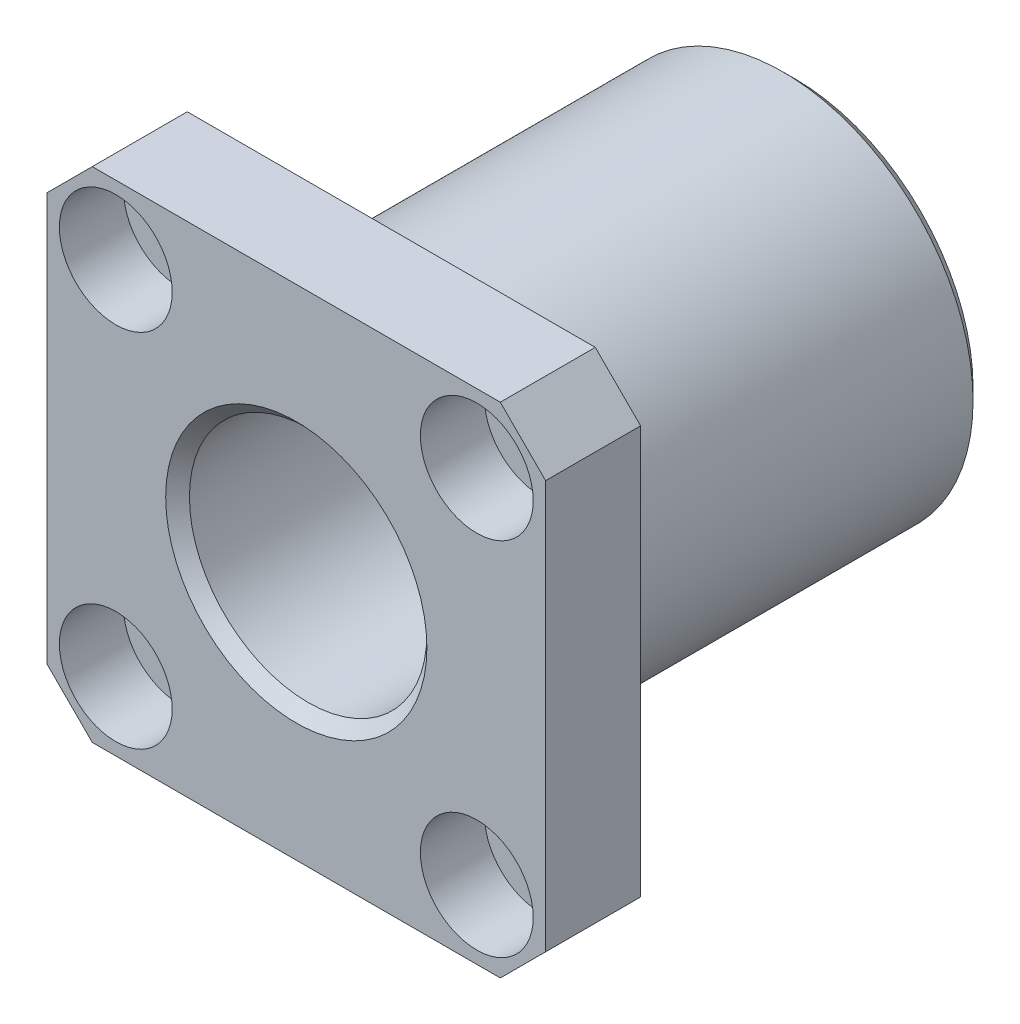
ISO-10303-21;
HEADER;
FILE_DESCRIPTION(('STEP AP214'),'2;1');
FILE_NAME('part.step','',(''),(''),'','','');
FILE_SCHEMA(('AUTOMOTIVE_DESIGN { 1 0 10303 214 1 1 1 1 }'));
ENDSEC;
DATA;
#1=APPLICATION_CONTEXT('core data for automotive mechanical design processes');
#2=APPLICATION_PROTOCOL_DEFINITION('international standard','automotive_design',2000,#1);
#3=PRODUCT_CONTEXT('',#1,'mechanical');
#4=PRODUCT('Part','Part','',(#3));
#5=PRODUCT_RELATED_PRODUCT_CATEGORY('part','',(#4));
#6=PRODUCT_DEFINITION_FORMATION('','',#4);
#7=PRODUCT_DEFINITION_CONTEXT('part definition',#1,'design');
#8=PRODUCT_DEFINITION('design','',#6,#7);
#9=PRODUCT_DEFINITION_SHAPE('','',#8);
#10=(LENGTH_UNIT() NAMED_UNIT(*) SI_UNIT(.MILLI.,.METRE.));
#11=(NAMED_UNIT(*) PLANE_ANGLE_UNIT() SI_UNIT($,.RADIAN.));
#12=(NAMED_UNIT(*) SI_UNIT($,.STERADIAN.) SOLID_ANGLE_UNIT());
#13=UNCERTAINTY_MEASURE_WITH_UNIT(LENGTH_MEASURE(1.E-05),#10,'distance_accuracy_value','');
#14=(GEOMETRIC_REPRESENTATION_CONTEXT(3) GLOBAL_UNCERTAINTY_ASSIGNED_CONTEXT((#13)) GLOBAL_UNIT_ASSIGNED_CONTEXT((#10,
#11,#12)) REPRESENTATION_CONTEXT('',''));
#15=CARTESIAN_POINT('',(0.,0.,0.));
#16=DIRECTION('',(0.,0.,1.));
#17=DIRECTION('',(1.,0.,0.));
#18=AXIS2_PLACEMENT_3D('',#15,#16,#17);
#19=CARTESIAN_POINT('',(0.,0.,41.));
#20=DIRECTION('',(0.,0.,1.));
#21=DIRECTION('',(1.,0.,0.));
#22=AXIS2_PLACEMENT_3D('',#19,#20,#21);
#23=CONICAL_SURFACE('',#22,10.,0.785398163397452);
#24=CARTESIAN_POINT('',(0.,0.,41.));
#25=DIRECTION('',(0.,0.,1.));
#26=DIRECTION('',(1.,0.,0.));
#27=AXIS2_PLACEMENT_3D('',#24,#25,#26);
#28=CIRCLE('',#27,10.);
#29=CARTESIAN_POINT('',(10.,0.,41.));
#30=VERTEX_POINT('',#29);
#31=CARTESIAN_POINT('',(-10.,0.,41.));
#32=VERTEX_POINT('',#31);
#33=EDGE_CURVE('E36',#30,#32,#28,.T.);
#34=ORIENTED_EDGE('',*,*,#33,.F.);
#35=CARTESIAN_POINT('',(0.,0.,41.));
#36=DIRECTION('',(0.,0.,1.));
#37=DIRECTION('',(1.,0.,0.));
#38=AXIS2_PLACEMENT_3D('',#35,#36,#37);
#39=CIRCLE('',#38,10.);
#40=EDGE_CURVE('E465',#32,#30,#39,.T.);
#41=ORIENTED_EDGE('',*,*,#40,.F.);
#42=DIRECTION('',(-0.70710678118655,0.,0.707106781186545));
#43=VECTOR('',#42,1.);
#44=CARTESIAN_POINT('',(-10.,0.,41.));
#45=LINE('',#44,#43);
#46=CARTESIAN_POINT('',(-11.,0.,42.));
#47=VERTEX_POINT('',#46);
#48=EDGE_CURVE('E9',#32,#47,#45,.T.);
#49=ORIENTED_EDGE('',*,*,#48,.T.);
#50=CARTESIAN_POINT('',(0.,0.,42.));
#51=DIRECTION('',(0.,0.,-1.));
#52=DIRECTION('',(1.,0.,0.));
#53=AXIS2_PLACEMENT_3D('',#50,#51,#52);
#54=CIRCLE('',#53,11.);
#55=CARTESIAN_POINT('',(11.,0.,42.));
#56=VERTEX_POINT('',#55);
#57=EDGE_CURVE('E374',#56,#47,#54,.T.);
#58=ORIENTED_EDGE('',*,*,#57,.F.);
#59=CARTESIAN_POINT('',(0.,0.,42.));
#60=DIRECTION('',(0.,0.,-1.));
#61=DIRECTION('',(1.,0.,0.));
#62=AXIS2_PLACEMENT_3D('',#59,#60,#61);
#63=CIRCLE('',#62,11.);
#64=EDGE_CURVE('E383',#47,#56,#63,.T.);
#65=ORIENTED_EDGE('',*,*,#64,.F.);
#66=ORIENTED_EDGE('',*,*,#48,.F.);
#67=EDGE_LOOP('',(#34,#41,#49,#58,#65,#66));
#68=FACE_BOUND('',#67,.T.);
#69=ADVANCED_FACE('F15',(#68),#23,.F.);
#70=CARTESIAN_POINT('',(0.,0.,1.00000000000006));
#71=DIRECTION('',(0.,0.,1.));
#72=DIRECTION('',(1.,0.,0.));
#73=AXIS2_PLACEMENT_3D('',#70,#71,#72);
#74=CONICAL_SURFACE('',#73,16.,0.78539816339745);
#75=CARTESIAN_POINT('',(0.,0.,1.00000000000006));
#76=DIRECTION('',(0.,0.,1.));
#77=DIRECTION('',(1.,0.,0.));
#78=AXIS2_PLACEMENT_3D('',#75,#76,#77);
#79=CIRCLE('',#78,16.);
#80=CARTESIAN_POINT('',(16.,0.,1.00000000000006));
#81=VERTEX_POINT('',#80);
#82=CARTESIAN_POINT('',(-16.,0.,1.00000000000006));
#83=VERTEX_POINT('',#82);
#84=EDGE_CURVE('E616',#81,#83,#79,.T.);
#85=ORIENTED_EDGE('',*,*,#84,.F.);
#86=CARTESIAN_POINT('',(0.,0.,1.00000000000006));
#87=DIRECTION('',(0.,0.,1.));
#88=DIRECTION('',(1.,0.,0.));
#89=AXIS2_PLACEMENT_3D('',#86,#87,#88);
#90=CIRCLE('',#89,16.);
#91=EDGE_CURVE('E480',#83,#81,#90,.T.);
#92=ORIENTED_EDGE('',*,*,#91,.F.);
#93=DIRECTION('',(0.707106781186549,0.,-0.707106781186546));
#94=VECTOR('',#93,1.);
#95=CARTESIAN_POINT('',(-16.,0.,1.00000000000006));
#96=LINE('',#95,#94);
#97=CARTESIAN_POINT('',(-15.,0.,0.));
#98=VERTEX_POINT('',#97);
#99=EDGE_CURVE('E24',#83,#98,#96,.T.);
#100=ORIENTED_EDGE('',*,*,#99,.T.);
#101=CARTESIAN_POINT('',(0.,0.,0.));
#102=DIRECTION('',(0.,0.,-1.));
#103=DIRECTION('',(1.,0.,0.));
#104=AXIS2_PLACEMENT_3D('',#101,#102,#103);
#105=CIRCLE('',#104,15.);
#106=CARTESIAN_POINT('',(15.,0.,0.));
#107=VERTEX_POINT('',#106);
#108=EDGE_CURVE('E478',#107,#98,#105,.T.);
#109=ORIENTED_EDGE('',*,*,#108,.F.);
#110=CARTESIAN_POINT('',(0.,0.,0.));
#111=DIRECTION('',(0.,0.,-1.));
#112=DIRECTION('',(1.,0.,0.));
#113=AXIS2_PLACEMENT_3D('',#110,#111,#112);
#114=CIRCLE('',#113,15.);
#115=EDGE_CURVE('E482',#98,#107,#114,.T.);
#116=ORIENTED_EDGE('',*,*,#115,.F.);
#117=ORIENTED_EDGE('',*,*,#99,.F.);
#118=EDGE_LOOP('',(#85,#92,#100,#109,#116,#117));
#119=FACE_BOUND('',#118,.T.);
#120=ADVANCED_FACE('F17',(#119),#74,.T.);
#121=CARTESIAN_POINT('',(0.,0.,0.));
#122=DIRECTION('',(0.,0.,1.));
#123=DIRECTION('',(1.,0.,0.));
#124=AXIS2_PLACEMENT_3D('',#121,#122,#123);
#125=CYLINDRICAL_SURFACE('',#124,10.);
#126=CARTESIAN_POINT('',(0.,0.,0.));
#127=DIRECTION('',(0.,0.,1.));
#128=DIRECTION('',(1.,0.,0.));
#129=AXIS2_PLACEMENT_3D('',#126,#127,#128);
#130=CIRCLE('',#129,10.);
#131=CARTESIAN_POINT('',(10.,0.,0.));
#132=VERTEX_POINT('',#131);
#133=CARTESIAN_POINT('',(-10.,0.,0.));
#134=VERTEX_POINT('',#133);
#135=EDGE_CURVE('E485',#132,#134,#130,.T.);
#136=ORIENTED_EDGE('',*,*,#135,.F.);
#137=CARTESIAN_POINT('',(0.,0.,0.));
#138=DIRECTION('',(0.,0.,1.));
#139=DIRECTION('',(1.,0.,0.));
#140=AXIS2_PLACEMENT_3D('',#137,#138,#139);
#141=CIRCLE('',#140,10.);
#142=EDGE_CURVE('E505',#134,#132,#141,.T.);
#143=ORIENTED_EDGE('',*,*,#142,.F.);
#144=DIRECTION('',(0.,0.,1.));
#145=VECTOR('',#144,1.);
#146=CARTESIAN_POINT('',(-10.,0.,0.));
#147=LINE('',#146,#145);
#148=EDGE_CURVE('E461',#134,#32,#147,.T.);
#149=ORIENTED_EDGE('',*,*,#148,.T.);
#150=ORIENTED_EDGE('',*,*,#40,.T.);
#151=ORIENTED_EDGE('',*,*,#33,.T.);
#152=ORIENTED_EDGE('',*,*,#148,.F.);
#153=EDGE_LOOP('',(#136,#143,#149,#150,#151,#152));
#154=FACE_BOUND('',#153,.T.);
#155=ADVANCED_FACE('F578',(#154),#125,.F.);
#156=CARTESIAN_POINT('',(-15.2027957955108,15.2027957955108,42.));
#157=DIRECTION('',(0.,0.,1.));
#158=DIRECTION('',(1.,0.,0.));
#159=AXIS2_PLACEMENT_3D('',#156,#157,#158);
#160=CYLINDRICAL_SURFACE('',#159,4.75);
#161=CARTESIAN_POINT('',(-15.2027957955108,15.2027957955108,36.6));
#162=DIRECTION('',(0.,0.,1.));
#163=DIRECTION('',(1.,0.,0.));
#164=AXIS2_PLACEMENT_3D('',#161,#162,#163);
#165=CIRCLE('',#164,4.75);
#166=CARTESIAN_POINT('',(-10.4527957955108,15.2027957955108,36.6));
#167=VERTEX_POINT('',#166);
#168=CARTESIAN_POINT('',(-19.9527957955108,15.2027957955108,36.6));
#169=VERTEX_POINT('',#168);
#170=EDGE_CURVE('E451',#167,#169,#165,.T.);
#171=ORIENTED_EDGE('',*,*,#170,.F.);
#172=CARTESIAN_POINT('',(-15.2027957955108,15.2027957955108,36.6));
#173=DIRECTION('',(0.,0.,1.));
#174=DIRECTION('',(1.,0.,0.));
#175=AXIS2_PLACEMENT_3D('',#172,#173,#174);
#176=CIRCLE('',#175,4.75);
#177=EDGE_CURVE('E455',#169,#167,#176,.T.);
#178=ORIENTED_EDGE('',*,*,#177,.F.);
#179=DIRECTION('',(0.,0.,1.));
#180=VECTOR('',#179,1.);
#181=CARTESIAN_POINT('',(-19.9527957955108,15.2027957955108,42.));
#182=LINE('',#181,#180);
#183=CARTESIAN_POINT('',(-19.9527957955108,15.2027957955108,42.));
#184=VERTEX_POINT('',#183);
#185=EDGE_CURVE('E458',#169,#184,#182,.T.);
#186=ORIENTED_EDGE('',*,*,#185,.T.);
#187=CARTESIAN_POINT('',(-15.2027957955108,15.2027957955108,42.));
#188=DIRECTION('',(0.,0.,1.));
#189=DIRECTION('',(1.,0.,0.));
#190=AXIS2_PLACEMENT_3D('',#187,#188,#189);
#191=CIRCLE('',#190,4.75);
#192=CARTESIAN_POINT('',(-10.4527957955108,15.2027957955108,42.));
#193=VERTEX_POINT('',#192);
#194=EDGE_CURVE('E390',#184,#193,#191,.T.);
#195=ORIENTED_EDGE('',*,*,#194,.T.);
#196=CARTESIAN_POINT('',(-15.2027957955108,15.2027957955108,42.));
#197=DIRECTION('',(0.,0.,1.));
#198=DIRECTION('',(1.,0.,0.));
#199=AXIS2_PLACEMENT_3D('',#196,#197,#198);
#200=CIRCLE('',#199,4.75);
#201=EDGE_CURVE('E386',#193,#184,#200,.T.);
#202=ORIENTED_EDGE('',*,*,#201,.T.);
#203=ORIENTED_EDGE('',*,*,#185,.F.);
#204=EDGE_LOOP('',(#171,#178,#186,#195,#202,#203));
#205=FACE_BOUND('',#204,.T.);
#206=ADVANCED_FACE('F594',(#205),#160,.F.);
#207=CARTESIAN_POINT('',(-12.4527957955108,15.2027957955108,36.6));
#208=DIRECTION('',(0.,0.,-1.));
#209=DIRECTION('',(0.,-1.,0.));
#210=AXIS2_PLACEMENT_3D('',#207,#208,#209);
#211=PLANE('',#210);
#212=CARTESIAN_POINT('',(-15.2027957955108,15.2027957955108,36.6));
#213=DIRECTION('',(0.,0.,1.));
#214=DIRECTION('',(1.,0.,0.));
#215=AXIS2_PLACEMENT_3D('',#212,#213,#214);
#216=CIRCLE('',#215,2.75);
#217=CARTESIAN_POINT('',(-12.4527957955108,15.2027957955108,36.6));
#218=VERTEX_POINT('',#217);
#219=CARTESIAN_POINT('',(-17.9527957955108,15.2027957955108,36.6));
#220=VERTEX_POINT('',#219);
#221=EDGE_CURVE('E448',#218,#220,#216,.T.);
#222=ORIENTED_EDGE('',*,*,#221,.F.);
#223=CARTESIAN_POINT('',(-15.2027957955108,15.2027957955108,36.6));
#224=DIRECTION('',(0.,0.,1.));
#225=DIRECTION('',(1.,0.,0.));
#226=AXIS2_PLACEMENT_3D('',#223,#224,#225);
#227=CIRCLE('',#226,2.75);
#228=EDGE_CURVE('E444',#220,#218,#227,.T.);
#229=ORIENTED_EDGE('',*,*,#228,.F.);
#230=EDGE_LOOP('',(#222,#229));
#231=FACE_BOUND('',#230,.T.);
#232=ORIENTED_EDGE('',*,*,#170,.T.);
#233=ORIENTED_EDGE('',*,*,#177,.T.);
#234=EDGE_LOOP('',(#232,#233));
#235=FACE_BOUND('',#234,.T.);
#236=ADVANCED_FACE('F592',(#231,#235),#211,.F.);
#237=CARTESIAN_POINT('',(-15.2027957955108,15.2027957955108,42.));
#238=DIRECTION('',(0.,0.,1.));
#239=DIRECTION('',(1.,0.,0.));
#240=AXIS2_PLACEMENT_3D('',#237,#238,#239);
#241=CYLINDRICAL_SURFACE('',#240,2.75);
#242=CARTESIAN_POINT('',(-15.2027957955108,15.2027957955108,34.));
#243=DIRECTION('',(0.,0.,-1.));
#244=DIRECTION('',(-1.,0.,0.));
#245=AXIS2_PLACEMENT_3D('',#242,#243,#244);
#246=CIRCLE('',#245,2.75);
#247=CARTESIAN_POINT('',(-17.9527957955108,15.2027957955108,34.));
#248=VERTEX_POINT('',#247);
#249=EDGE_CURVE('E350',#248,#248,#246,.T.);
#250=ORIENTED_EDGE('',*,*,#249,.T.);
#251=DIRECTION('',(0.,0.,1.));
#252=VECTOR('',#251,1.);
#253=CARTESIAN_POINT('',(-17.9527957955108,15.2027957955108,42.));
#254=LINE('',#253,#252);
#255=EDGE_CURVE('E378',#248,#220,#254,.T.);
#256=ORIENTED_EDGE('',*,*,#255,.T.);
#257=ORIENTED_EDGE('',*,*,#228,.T.);
#258=ORIENTED_EDGE('',*,*,#221,.T.);
#259=ORIENTED_EDGE('',*,*,#255,.F.);
#260=EDGE_LOOP('',(#250,#256,#257,#258,#259));
#261=FACE_BOUND('',#260,.T.);
#262=ADVANCED_FACE('F590',(#261),#241,.F.);
#263=CARTESIAN_POINT('',(15.2027957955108,15.2027957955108,42.));
#264=DIRECTION('',(0.,0.,1.));
#265=DIRECTION('',(1.,0.,0.));
#266=AXIS2_PLACEMENT_3D('',#263,#264,#265);
#267=CYLINDRICAL_SURFACE('',#266,4.75);
#268=CARTESIAN_POINT('',(15.2027957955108,15.2027957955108,36.6));
#269=DIRECTION('',(0.,0.,1.));
#270=DIRECTION('',(1.,0.,0.));
#271=AXIS2_PLACEMENT_3D('',#268,#269,#270);
#272=CIRCLE('',#271,4.75);
#273=CARTESIAN_POINT('',(19.9527957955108,15.2027957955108,36.6));
#274=VERTEX_POINT('',#273);
#275=CARTESIAN_POINT('',(10.4527957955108,15.2027957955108,36.6));
#276=VERTEX_POINT('',#275);
#277=EDGE_CURVE('E417',#274,#276,#272,.T.);
#278=ORIENTED_EDGE('',*,*,#277,.F.);
#279=CARTESIAN_POINT('',(15.2027957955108,15.2027957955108,36.6));
#280=DIRECTION('',(0.,0.,1.));
#281=DIRECTION('',(1.,0.,0.));
#282=AXIS2_PLACEMENT_3D('',#279,#280,#281);
#283=CIRCLE('',#282,4.75);
#284=EDGE_CURVE('E379',#276,#274,#283,.T.);
#285=ORIENTED_EDGE('',*,*,#284,.F.);
#286=DIRECTION('',(0.,0.,1.));
#287=VECTOR('',#286,1.);
#288=CARTESIAN_POINT('',(10.4527957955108,15.2027957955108,42.));
#289=LINE('',#288,#287);
#290=CARTESIAN_POINT('',(10.4527957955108,15.2027957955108,42.));
#291=VERTEX_POINT('',#290);
#292=EDGE_CURVE('E375',#276,#291,#289,.T.);
#293=ORIENTED_EDGE('',*,*,#292,.T.);
#294=CARTESIAN_POINT('',(15.2027957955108,15.2027957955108,42.));
#295=DIRECTION('',(0.,0.,1.));
#296=DIRECTION('',(1.,0.,0.));
#297=AXIS2_PLACEMENT_3D('',#294,#295,#296);
#298=CIRCLE('',#297,4.75);
#299=CARTESIAN_POINT('',(19.9527957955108,15.2027957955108,42.));
#300=VERTEX_POINT('',#299);
#301=EDGE_CURVE('E347',#291,#300,#298,.T.);
#302=ORIENTED_EDGE('',*,*,#301,.T.);
#303=CARTESIAN_POINT('',(15.2027957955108,15.2027957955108,42.));
#304=DIRECTION('',(0.,0.,1.));
#305=DIRECTION('',(1.,0.,0.));
#306=AXIS2_PLACEMENT_3D('',#303,#304,#305);
#307=CIRCLE('',#306,4.75);
#308=EDGE_CURVE('E393',#300,#291,#307,.T.);
#309=ORIENTED_EDGE('',*,*,#308,.T.);
#310=ORIENTED_EDGE('',*,*,#292,.F.);
#311=EDGE_LOOP('',(#278,#285,#293,#302,#309,#310));
#312=FACE_BOUND('',#311,.T.);
#313=ADVANCED_FACE('F586',(#312),#267,.F.);
#314=CARTESIAN_POINT('',(17.9527957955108,15.2027957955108,36.6));
#315=DIRECTION('',(0.,0.,-1.));
#316=DIRECTION('',(0.,-1.,0.));
#317=AXIS2_PLACEMENT_3D('',#314,#315,#316);
#318=PLANE('',#317);
#319=CARTESIAN_POINT('',(15.2027957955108,15.2027957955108,36.6));
#320=DIRECTION('',(0.,0.,1.));
#321=DIRECTION('',(1.,0.,0.));
#322=AXIS2_PLACEMENT_3D('',#319,#320,#321);
#323=CIRCLE('',#322,2.75);
#324=CARTESIAN_POINT('',(17.9527957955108,15.2027957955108,36.6));
#325=VERTEX_POINT('',#324);
#326=CARTESIAN_POINT('',(12.4527957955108,15.2027957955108,36.6));
#327=VERTEX_POINT('',#326);
#328=EDGE_CURVE('E434',#325,#327,#323,.T.);
#329=ORIENTED_EDGE('',*,*,#328,.F.);
#330=CARTESIAN_POINT('',(15.2027957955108,15.2027957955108,36.6));
#331=DIRECTION('',(0.,0.,1.));
#332=DIRECTION('',(1.,0.,0.));
#333=AXIS2_PLACEMENT_3D('',#330,#331,#332);
#334=CIRCLE('',#333,2.75);
#335=EDGE_CURVE('E437',#327,#325,#334,.T.);
#336=ORIENTED_EDGE('',*,*,#335,.F.);
#337=EDGE_LOOP('',(#329,#336));
#338=FACE_BOUND('',#337,.T.);
#339=ORIENTED_EDGE('',*,*,#277,.T.);
#340=ORIENTED_EDGE('',*,*,#284,.T.);
#341=EDGE_LOOP('',(#339,#340));
#342=FACE_BOUND('',#341,.T.);
#343=ADVANCED_FACE('F583',(#338,#342),#318,.F.);
#344=CARTESIAN_POINT('',(15.2027957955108,15.2027957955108,42.));
#345=DIRECTION('',(0.,0.,1.));
#346=DIRECTION('',(1.,0.,0.));
#347=AXIS2_PLACEMENT_3D('',#344,#345,#346);
#348=CYLINDRICAL_SURFACE('',#347,2.75);
#349=CARTESIAN_POINT('',(15.2027957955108,15.2027957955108,34.));
#350=DIRECTION('',(0.,0.,-1.));
#351=DIRECTION('',(-1.,0.,0.));
#352=AXIS2_PLACEMENT_3D('',#349,#350,#351);
#353=CIRCLE('',#352,2.75);
#354=CARTESIAN_POINT('',(12.4527957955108,15.2027957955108,34.));
#355=VERTEX_POINT('',#354);
#356=EDGE_CURVE('E354',#355,#355,#353,.T.);
#357=ORIENTED_EDGE('',*,*,#356,.T.);
#358=DIRECTION('',(0.,0.,1.));
#359=VECTOR('',#358,1.);
#360=CARTESIAN_POINT('',(12.4527957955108,15.2027957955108,42.));
#361=LINE('',#360,#359);
#362=EDGE_CURVE('E433',#355,#327,#361,.T.);
#363=ORIENTED_EDGE('',*,*,#362,.T.);
#364=ORIENTED_EDGE('',*,*,#335,.T.);
#365=ORIENTED_EDGE('',*,*,#328,.T.);
#366=ORIENTED_EDGE('',*,*,#362,.F.);
#367=EDGE_LOOP('',(#357,#363,#364,#365,#366));
#368=FACE_BOUND('',#367,.T.);
#369=ADVANCED_FACE('F581',(#368),#348,.F.);
#370=CARTESIAN_POINT('',(15.2027957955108,-15.2027957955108,42.));
#371=DIRECTION('',(0.,0.,1.));
#372=DIRECTION('',(1.,0.,0.));
#373=AXIS2_PLACEMENT_3D('',#370,#371,#372);
#374=CYLINDRICAL_SURFACE('',#373,4.75);
#375=CARTESIAN_POINT('',(15.2027957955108,-15.2027957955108,36.6));
#376=DIRECTION('',(0.,0.,1.));
#377=DIRECTION('',(1.,0.,0.));
#378=AXIS2_PLACEMENT_3D('',#375,#376,#377);
#379=CIRCLE('',#378,4.75);
#380=CARTESIAN_POINT('',(19.9527957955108,-15.2027957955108,36.6));
#381=VERTEX_POINT('',#380);
#382=CARTESIAN_POINT('',(10.4527957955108,-15.2027957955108,36.6));
#383=VERTEX_POINT('',#382);
#384=EDGE_CURVE('E425',#381,#383,#379,.T.);
#385=ORIENTED_EDGE('',*,*,#384,.F.);
#386=CARTESIAN_POINT('',(15.2027957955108,-15.2027957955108,36.6));
#387=DIRECTION('',(0.,0.,1.));
#388=DIRECTION('',(1.,0.,0.));
#389=AXIS2_PLACEMENT_3D('',#386,#387,#388);
#390=CIRCLE('',#389,4.75);
#391=EDGE_CURVE('E429',#383,#381,#390,.T.);
#392=ORIENTED_EDGE('',*,*,#391,.F.);
#393=DIRECTION('',(0.,0.,1.));
#394=VECTOR('',#393,1.);
#395=CARTESIAN_POINT('',(10.4527957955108,-15.2027957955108,42.));
#396=LINE('',#395,#394);
#397=CARTESIAN_POINT('',(10.4527957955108,-15.2027957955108,42.));
#398=VERTEX_POINT('',#397);
#399=EDGE_CURVE('E430',#383,#398,#396,.T.);
#400=ORIENTED_EDGE('',*,*,#399,.T.);
#401=CARTESIAN_POINT('',(15.2027957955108,-15.2027957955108,42.));
#402=DIRECTION('',(0.,0.,1.));
#403=DIRECTION('',(1.,0.,0.));
#404=AXIS2_PLACEMENT_3D('',#401,#402,#403);
#405=CIRCLE('',#404,4.75);
#406=CARTESIAN_POINT('',(19.9527957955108,-15.2027957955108,42.));
#407=VERTEX_POINT('',#406);
#408=EDGE_CURVE('E346',#398,#407,#405,.T.);
#409=ORIENTED_EDGE('',*,*,#408,.T.);
#410=CARTESIAN_POINT('',(15.2027957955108,-15.2027957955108,42.));
#411=DIRECTION('',(0.,0.,1.));
#412=DIRECTION('',(1.,0.,0.));
#413=AXIS2_PLACEMENT_3D('',#410,#411,#412);
#414=CIRCLE('',#413,4.75);
#415=EDGE_CURVE('E342',#407,#398,#414,.T.);
#416=ORIENTED_EDGE('',*,*,#415,.T.);
#417=ORIENTED_EDGE('',*,*,#399,.F.);
#418=EDGE_LOOP('',(#385,#392,#400,#409,#416,#417));
#419=FACE_BOUND('',#418,.T.);
#420=ADVANCED_FACE('F673',(#419),#374,.F.);
#421=CARTESIAN_POINT('',(17.9527957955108,-15.2027957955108,36.6));
#422=DIRECTION('',(0.,0.,-1.));
#423=DIRECTION('',(0.,-1.,0.));
#424=AXIS2_PLACEMENT_3D('',#421,#422,#423);
#425=PLANE('',#424);
#426=CARTESIAN_POINT('',(15.2027957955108,-15.2027957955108,36.6));
#427=DIRECTION('',(0.,0.,1.));
#428=DIRECTION('',(1.,0.,0.));
#429=AXIS2_PLACEMENT_3D('',#426,#427,#428);
#430=CIRCLE('',#429,2.75);
#431=CARTESIAN_POINT('',(17.9527957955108,-15.2027957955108,36.6));
#432=VERTEX_POINT('',#431);
#433=CARTESIAN_POINT('',(12.4527957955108,-15.2027957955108,36.6));
#434=VERTEX_POINT('',#433);
#435=EDGE_CURVE('E422',#432,#434,#430,.T.);
#436=ORIENTED_EDGE('',*,*,#435,.F.);
#437=CARTESIAN_POINT('',(15.2027957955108,-15.2027957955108,36.6));
#438=DIRECTION('',(0.,0.,1.));
#439=DIRECTION('',(1.,0.,0.));
#440=AXIS2_PLACEMENT_3D('',#437,#438,#439);
#441=CIRCLE('',#440,2.75);
#442=EDGE_CURVE('E418',#434,#432,#441,.T.);
#443=ORIENTED_EDGE('',*,*,#442,.F.);
#444=EDGE_LOOP('',(#436,#443));
#445=FACE_BOUND('',#444,.T.);
#446=ORIENTED_EDGE('',*,*,#384,.T.);
#447=ORIENTED_EDGE('',*,*,#391,.T.);
#448=EDGE_LOOP('',(#446,#447));
#449=FACE_BOUND('',#448,.T.);
#450=ADVANCED_FACE('F667',(#445,#449),#425,.F.);
#451=CARTESIAN_POINT('',(15.2027957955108,-15.2027957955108,42.));
#452=DIRECTION('',(0.,0.,1.));
#453=DIRECTION('',(1.,0.,0.));
#454=AXIS2_PLACEMENT_3D('',#451,#452,#453);
#455=CYLINDRICAL_SURFACE('',#454,2.75);
#456=CARTESIAN_POINT('',(15.2027957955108,-15.2027957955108,34.));
#457=DIRECTION('',(0.,0.,-1.));
#458=DIRECTION('',(-1.,0.,0.));
#459=AXIS2_PLACEMENT_3D('',#456,#457,#458);
#460=CIRCLE('',#459,2.75);
#461=CARTESIAN_POINT('',(12.4527957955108,-15.2027957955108,34.));
#462=VERTEX_POINT('',#461);
#463=EDGE_CURVE('E358',#462,#462,#460,.T.);
#464=ORIENTED_EDGE('',*,*,#463,.T.);
#465=DIRECTION('',(0.,0.,1.));
#466=VECTOR('',#465,1.);
#467=CARTESIAN_POINT('',(12.4527957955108,-15.2027957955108,42.));
#468=LINE('',#467,#466);
#469=EDGE_CURVE('E414',#462,#434,#468,.T.);
#470=ORIENTED_EDGE('',*,*,#469,.T.);
#471=ORIENTED_EDGE('',*,*,#442,.T.);
#472=ORIENTED_EDGE('',*,*,#435,.T.);
#473=ORIENTED_EDGE('',*,*,#469,.F.);
#474=EDGE_LOOP('',(#464,#470,#471,#472,#473));
#475=FACE_BOUND('',#474,.T.);
#476=ADVANCED_FACE('F663',(#475),#455,.F.);
#477=CARTESIAN_POINT('',(-15.2027957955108,-15.2027957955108,42.));
#478=DIRECTION('',(0.,0.,1.));
#479=DIRECTION('',(1.,0.,0.));
#480=AXIS2_PLACEMENT_3D('',#477,#478,#479);
#481=CYLINDRICAL_SURFACE('',#480,4.75);
#482=CARTESIAN_POINT('',(-15.2027957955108,-15.2027957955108,36.6));
#483=DIRECTION('',(0.,0.,1.));
#484=DIRECTION('',(1.,0.,0.));
#485=AXIS2_PLACEMENT_3D('',#482,#483,#484);
#486=CIRCLE('',#485,4.75);
#487=CARTESIAN_POINT('',(-10.4527957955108,-15.2027957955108,36.6));
#488=VERTEX_POINT('',#487);
#489=CARTESIAN_POINT('',(-19.9527957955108,-15.2027957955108,36.6));
#490=VERTEX_POINT('',#489);
#491=EDGE_CURVE('E371',#488,#490,#486,.T.);
#492=ORIENTED_EDGE('',*,*,#491,.F.);
#493=CARTESIAN_POINT('',(-15.2027957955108,-15.2027957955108,36.6));
#494=DIRECTION('',(0.,0.,1.));
#495=DIRECTION('',(1.,0.,0.));
#496=AXIS2_PLACEMENT_3D('',#493,#494,#495);
#497=CIRCLE('',#496,4.75);
#498=EDGE_CURVE('E408',#490,#488,#497,.T.);
#499=ORIENTED_EDGE('',*,*,#498,.F.);
#500=DIRECTION('',(0.,0.,1.));
#501=VECTOR('',#500,1.);
#502=CARTESIAN_POINT('',(-19.9527957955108,-15.2027957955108,42.));
#503=LINE('',#502,#501);
#504=CARTESIAN_POINT('',(-19.9527957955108,-15.2027957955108,42.));
#505=VERTEX_POINT('',#504);
#506=EDGE_CURVE('E411',#490,#505,#503,.T.);
#507=ORIENTED_EDGE('',*,*,#506,.T.);
#508=CARTESIAN_POINT('',(-15.2027957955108,-15.2027957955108,42.));
#509=DIRECTION('',(0.,0.,1.));
#510=DIRECTION('',(1.,0.,0.));
#511=AXIS2_PLACEMENT_3D('',#508,#509,#510);
#512=CIRCLE('',#511,4.75);
#513=CARTESIAN_POINT('',(-10.4527957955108,-15.2027957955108,42.));
#514=VERTEX_POINT('',#513);
#515=EDGE_CURVE('E399',#505,#514,#512,.T.);
#516=ORIENTED_EDGE('',*,*,#515,.T.);
#517=CARTESIAN_POINT('',(-15.2027957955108,-15.2027957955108,42.));
#518=DIRECTION('',(0.,0.,1.));
#519=DIRECTION('',(1.,0.,0.));
#520=AXIS2_PLACEMENT_3D('',#517,#518,#519);
#521=CIRCLE('',#520,4.75);
#522=EDGE_CURVE('E389',#514,#505,#521,.T.);
#523=ORIENTED_EDGE('',*,*,#522,.T.);
#524=ORIENTED_EDGE('',*,*,#506,.F.);
#525=EDGE_LOOP('',(#492,#499,#507,#516,#523,#524));
#526=FACE_BOUND('',#525,.T.);
#527=ADVANCED_FACE('F659',(#526),#481,.F.);
#528=CARTESIAN_POINT('',(-12.4527957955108,-15.2027957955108,36.6));
#529=DIRECTION('',(0.,0.,-1.));
#530=DIRECTION('',(0.,-1.,0.));
#531=AXIS2_PLACEMENT_3D('',#528,#529,#530);
#532=PLANE('',#531);
#533=CARTESIAN_POINT('',(-15.2027957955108,-15.2027957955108,36.6));
#534=DIRECTION('',(0.,0.,1.));
#535=DIRECTION('',(1.,0.,0.));
#536=AXIS2_PLACEMENT_3D('',#533,#534,#535);
#537=CIRCLE('',#536,2.75);
#538=CARTESIAN_POINT('',(-12.4527957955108,-15.2027957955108,36.6));
#539=VERTEX_POINT('',#538);
#540=CARTESIAN_POINT('',(-17.9527957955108,-15.2027957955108,36.6));
#541=VERTEX_POINT('',#540);
#542=EDGE_CURVE('E318',#539,#541,#537,.T.);
#543=ORIENTED_EDGE('',*,*,#542,.F.);
#544=CARTESIAN_POINT('',(-15.2027957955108,-15.2027957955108,36.6));
#545=DIRECTION('',(0.,0.,1.));
#546=DIRECTION('',(1.,0.,0.));
#547=AXIS2_PLACEMENT_3D('',#544,#545,#546);
#548=CIRCLE('',#547,2.75);
#549=EDGE_CURVE('E314',#541,#539,#548,.T.);
#550=ORIENTED_EDGE('',*,*,#549,.F.);
#551=EDGE_LOOP('',(#543,#550));
#552=FACE_BOUND('',#551,.T.);
#553=ORIENTED_EDGE('',*,*,#491,.T.);
#554=ORIENTED_EDGE('',*,*,#498,.T.);
#555=EDGE_LOOP('',(#553,#554));
#556=FACE_BOUND('',#555,.T.);
#557=ADVANCED_FACE('F656',(#552,#556),#532,.F.);
#558=CARTESIAN_POINT('',(-15.2027957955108,-15.2027957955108,42.));
#559=DIRECTION('',(0.,0.,1.));
#560=DIRECTION('',(1.,0.,0.));
#561=AXIS2_PLACEMENT_3D('',#558,#559,#560);
#562=CYLINDRICAL_SURFACE('',#561,2.75);
#563=CARTESIAN_POINT('',(-15.2027957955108,-15.2027957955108,34.));
#564=DIRECTION('',(0.,0.,-1.));
#565=DIRECTION('',(-1.,0.,0.));
#566=AXIS2_PLACEMENT_3D('',#563,#564,#565);
#567=CIRCLE('',#566,2.75);
#568=CARTESIAN_POINT('',(-17.9527957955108,-15.2027957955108,34.));
#569=VERTEX_POINT('',#568);
#570=EDGE_CURVE('E362',#569,#569,#567,.T.);
#571=ORIENTED_EDGE('',*,*,#570,.T.);
#572=DIRECTION('',(0.,0.,1.));
#573=VECTOR('',#572,1.);
#574=CARTESIAN_POINT('',(-17.9527957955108,-15.2027957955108,42.));
#575=LINE('',#574,#573);
#576=EDGE_CURVE('E319',#569,#541,#575,.T.);
#577=ORIENTED_EDGE('',*,*,#576,.T.);
#578=ORIENTED_EDGE('',*,*,#549,.T.);
#579=ORIENTED_EDGE('',*,*,#542,.T.);
#580=ORIENTED_EDGE('',*,*,#576,.F.);
#581=EDGE_LOOP('',(#571,#577,#578,#579,#580));
#582=FACE_BOUND('',#581,.T.);
#583=ADVANCED_FACE('F646',(#582),#562,.F.);
#584=CARTESIAN_POINT('',(-21.,-17.1837661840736,0.));
#585=DIRECTION('',(0.707106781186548,0.707106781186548,0.));
#586=DIRECTION('',(0.,0.,-1.));
#587=AXIS2_PLACEMENT_3D('',#584,#585,#586);
#588=PLANE('',#587);
#589=DIRECTION('',(0.707106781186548,-0.707106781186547,0.));
#590=VECTOR('',#589,1.);
#591=CARTESIAN_POINT('',(-21.,-17.1837661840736,34.));
#592=LINE('',#591,#590);
#593=CARTESIAN_POINT('',(-21.,-17.1837661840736,34.));
#594=VERTEX_POINT('',#593);
#595=CARTESIAN_POINT('',(-17.1837661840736,-21.,34.));
#596=VERTEX_POINT('',#595);
#597=EDGE_CURVE('E302',#594,#596,#592,.T.);
#598=ORIENTED_EDGE('',*,*,#597,.T.);
#599=DIRECTION('',(0.,0.,1.));
#600=VECTOR('',#599,1.);
#601=CARTESIAN_POINT('',(-17.1837661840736,-21.,34.));
#602=LINE('',#601,#600);
#603=CARTESIAN_POINT('',(-17.1837661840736,-21.,42.));
#604=VERTEX_POINT('',#603);
#605=EDGE_CURVE('E283',#596,#604,#602,.T.);
#606=ORIENTED_EDGE('',*,*,#605,.T.);
#607=DIRECTION('',(-0.707106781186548,0.707106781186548,0.));
#608=VECTOR('',#607,1.);
#609=CARTESIAN_POINT('',(-17.1837661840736,-21.,42.));
#610=LINE('',#609,#608);
#611=CARTESIAN_POINT('',(-21.,-17.1837661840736,42.));
#612=VERTEX_POINT('',#611);
#613=EDGE_CURVE('E366',#604,#612,#610,.T.);
#614=ORIENTED_EDGE('',*,*,#613,.T.);
#615=DIRECTION('',(0.,0.,1.));
#616=VECTOR('',#615,1.);
#617=CARTESIAN_POINT('',(-21.,-17.1837661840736,34.));
#618=LINE('',#617,#616);
#619=EDGE_CURVE('E313',#594,#612,#618,.T.);
#620=ORIENTED_EDGE('',*,*,#619,.F.);
#621=EDGE_LOOP('',(#598,#606,#614,#620));
#622=FACE_BOUND('',#621,.T.);
#623=ADVANCED_FACE('F543',(#622),#588,.F.);
#624=CARTESIAN_POINT('',(21.,-17.1837661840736,0.));
#625=DIRECTION('',(-0.707106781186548,0.707106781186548,0.));
#626=DIRECTION('',(0.,0.,1.));
#627=AXIS2_PLACEMENT_3D('',#624,#625,#626);
#628=PLANE('',#627);
#629=DIRECTION('',(0.707106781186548,0.707106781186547,0.));
#630=VECTOR('',#629,1.);
#631=CARTESIAN_POINT('',(17.1837661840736,-21.,34.));
#632=LINE('',#631,#630);
#633=CARTESIAN_POINT('',(17.1837661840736,-21.,34.));
#634=VERTEX_POINT('',#633);
#635=CARTESIAN_POINT('',(21.,-17.1837661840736,34.));
#636=VERTEX_POINT('',#635);
#637=EDGE_CURVE('E341',#634,#636,#632,.T.);
#638=ORIENTED_EDGE('',*,*,#637,.T.);
#639=DIRECTION('',(0.,0.,1.));
#640=VECTOR('',#639,1.);
#641=CARTESIAN_POINT('',(21.,-17.1837661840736,34.));
#642=LINE('',#641,#640);
#643=CARTESIAN_POINT('',(21.,-17.1837661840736,42.));
#644=VERTEX_POINT('',#643);
#645=EDGE_CURVE('E294',#636,#644,#642,.T.);
#646=ORIENTED_EDGE('',*,*,#645,.T.);
#647=DIRECTION('',(-0.707106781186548,-0.707106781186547,0.));
#648=VECTOR('',#647,1.);
#649=CARTESIAN_POINT('',(21.,-17.1837661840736,42.));
#650=LINE('',#649,#648);
#651=CARTESIAN_POINT('',(17.1837661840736,-21.,42.));
#652=VERTEX_POINT('',#651);
#653=EDGE_CURVE('E273',#644,#652,#650,.T.);
#654=ORIENTED_EDGE('',*,*,#653,.T.);
#655=DIRECTION('',(0.,0.,1.));
#656=VECTOR('',#655,1.);
#657=CARTESIAN_POINT('',(17.1837661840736,-21.,34.));
#658=LINE('',#657,#656);
#659=EDGE_CURVE('E516',#634,#652,#658,.T.);
#660=ORIENTED_EDGE('',*,*,#659,.F.);
#661=EDGE_LOOP('',(#638,#646,#654,#660));
#662=FACE_BOUND('',#661,.T.);
#663=ADVANCED_FACE('F521',(#662),#628,.F.);
#664=CARTESIAN_POINT('',(21.,17.1837661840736,0.));
#665=DIRECTION('',(-0.707106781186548,-0.707106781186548,0.));
#666=DIRECTION('',(-0.707106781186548,0.707106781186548,0.));
#667=AXIS2_PLACEMENT_3D('',#664,#665,#666);
#668=PLANE('',#667);
#669=DIRECTION('',(-0.707106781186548,0.707106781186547,0.));
#670=VECTOR('',#669,1.);
#671=CARTESIAN_POINT('',(21.,17.1837661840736,34.));
#672=LINE('',#671,#670);
#673=CARTESIAN_POINT('',(21.,17.1837661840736,34.));
#674=VERTEX_POINT('',#673);
#675=CARTESIAN_POINT('',(17.1837661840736,21.,34.));
#676=VERTEX_POINT('',#675);
#677=EDGE_CURVE('E338',#674,#676,#672,.T.);
#678=ORIENTED_EDGE('',*,*,#677,.T.);
#679=DIRECTION('',(0.,0.,1.));
#680=VECTOR('',#679,1.);
#681=CARTESIAN_POINT('',(17.1837661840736,21.,34.));
#682=LINE('',#681,#680);
#683=CARTESIAN_POINT('',(17.1837661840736,21.,42.));
#684=VERTEX_POINT('',#683);
#685=EDGE_CURVE('E267',#676,#684,#682,.T.);
#686=ORIENTED_EDGE('',*,*,#685,.T.);
#687=DIRECTION('',(0.707106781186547,-0.707106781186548,0.));
#688=VECTOR('',#687,1.);
#689=CARTESIAN_POINT('',(17.1837661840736,21.,42.));
#690=LINE('',#689,#688);
#691=CARTESIAN_POINT('',(21.,17.1837661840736,42.));
#692=VERTEX_POINT('',#691);
#693=EDGE_CURVE('E260',#684,#692,#690,.T.);
#694=ORIENTED_EDGE('',*,*,#693,.T.);
#695=DIRECTION('',(0.,0.,1.));
#696=VECTOR('',#695,1.);
#697=CARTESIAN_POINT('',(21.,17.1837661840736,34.));
#698=LINE('',#697,#696);
#699=EDGE_CURVE('E264',#674,#692,#698,.T.);
#700=ORIENTED_EDGE('',*,*,#699,.F.);
#701=EDGE_LOOP('',(#678,#686,#694,#700));
#702=FACE_BOUND('',#701,.T.);
#703=ADVANCED_FACE('F262',(#702),#668,.F.);
#704=CARTESIAN_POINT('',(-21.,17.1837661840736,0.));
#705=DIRECTION('',(0.707106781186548,-0.707106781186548,0.));
#706=DIRECTION('',(0.,0.,-1.));
#707=AXIS2_PLACEMENT_3D('',#704,#705,#706);
#708=PLANE('',#707);
#709=DIRECTION('',(-0.707106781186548,-0.707106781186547,0.));
#710=VECTOR('',#709,1.);
#711=CARTESIAN_POINT('',(-17.1837661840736,21.,34.));
#712=LINE('',#711,#710);
#713=CARTESIAN_POINT('',(-17.1837661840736,21.,34.));
#714=VERTEX_POINT('',#713);
#715=CARTESIAN_POINT('',(-21.,17.1837661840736,34.));
#716=VERTEX_POINT('',#715);
#717=EDGE_CURVE('E335',#714,#716,#712,.T.);
#718=ORIENTED_EDGE('',*,*,#717,.T.);
#719=DIRECTION('',(0.,0.,1.));
#720=VECTOR('',#719,1.);
#721=CARTESIAN_POINT('',(-21.,17.1837661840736,34.));
#722=LINE('',#721,#720);
#723=CARTESIAN_POINT('',(-21.,17.1837661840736,42.));
#724=VERTEX_POINT('',#723);
#725=EDGE_CURVE('E312',#716,#724,#722,.T.);
#726=ORIENTED_EDGE('',*,*,#725,.T.);
#727=DIRECTION('',(0.707106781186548,0.707106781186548,0.));
#728=VECTOR('',#727,1.);
#729=CARTESIAN_POINT('',(-21.,17.1837661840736,42.));
#730=LINE('',#729,#728);
#731=CARTESIAN_POINT('',(-17.1837661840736,21.,42.));
#732=VERTEX_POINT('',#731);
#733=EDGE_CURVE('E272',#724,#732,#730,.T.);
#734=ORIENTED_EDGE('',*,*,#733,.T.);
#735=DIRECTION('',(0.,0.,1.));
#736=VECTOR('',#735,1.);
#737=CARTESIAN_POINT('',(-17.1837661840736,21.,34.));
#738=LINE('',#737,#736);
#739=EDGE_CURVE('E303',#714,#732,#738,.T.);
#740=ORIENTED_EDGE('',*,*,#739,.F.);
#741=EDGE_LOOP('',(#718,#726,#734,#740));
#742=FACE_BOUND('',#741,.T.);
#743=ADVANCED_FACE('F538',(#742),#708,.F.);
#744=CARTESIAN_POINT('',(0.,0.,42.));
#745=DIRECTION('',(0.,0.,1.));
#746=DIRECTION('',(1.,0.,0.));
#747=AXIS2_PLACEMENT_3D('',#744,#745,#746);
#748=PLANE('',#747);
#749=ORIENTED_EDGE('',*,*,#522,.F.);
#750=ORIENTED_EDGE('',*,*,#515,.F.);
#751=EDGE_LOOP('',(#749,#750));
#752=FACE_BOUND('',#751,.T.);
#753=ORIENTED_EDGE('',*,*,#415,.F.);
#754=ORIENTED_EDGE('',*,*,#408,.F.);
#755=EDGE_LOOP('',(#753,#754));
#756=FACE_BOUND('',#755,.T.);
#757=ORIENTED_EDGE('',*,*,#308,.F.);
#758=ORIENTED_EDGE('',*,*,#301,.F.);
#759=EDGE_LOOP('',(#757,#758));
#760=FACE_BOUND('',#759,.T.);
#761=ORIENTED_EDGE('',*,*,#201,.F.);
#762=ORIENTED_EDGE('',*,*,#194,.F.);
#763=EDGE_LOOP('',(#761,#762));
#764=FACE_BOUND('',#763,.T.);
#765=ORIENTED_EDGE('',*,*,#57,.T.);
#766=ORIENTED_EDGE('',*,*,#64,.T.);
#767=EDGE_LOOP('',(#765,#766));
#768=FACE_BOUND('',#767,.T.);
#769=ORIENTED_EDGE('',*,*,#613,.F.);
#770=DIRECTION('',(1.,0.,0.));
#771=VECTOR('',#770,1.);
#772=CARTESIAN_POINT('',(-17.1837661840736,-21.,42.));
#773=LINE('',#772,#771);
#774=EDGE_CURVE('E298',#604,#652,#773,.T.);
#775=ORIENTED_EDGE('',*,*,#774,.T.);
#776=ORIENTED_EDGE('',*,*,#653,.F.);
#777=DIRECTION('',(0.,1.,0.));
#778=VECTOR('',#777,1.);
#779=CARTESIAN_POINT('',(21.,-17.1837661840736,42.));
#780=LINE('',#779,#778);
#781=EDGE_CURVE('E276',#644,#692,#780,.T.);
#782=ORIENTED_EDGE('',*,*,#781,.T.);
#783=ORIENTED_EDGE('',*,*,#693,.F.);
#784=DIRECTION('',(-1.,0.,0.));
#785=VECTOR('',#784,1.);
#786=CARTESIAN_POINT('',(17.1837661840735,21.,42.));
#787=LINE('',#786,#785);
#788=EDGE_CURVE('E299',#684,#732,#787,.T.);
#789=ORIENTED_EDGE('',*,*,#788,.T.);
#790=ORIENTED_EDGE('',*,*,#733,.F.);
#791=DIRECTION('',(0.,-1.,0.));
#792=VECTOR('',#791,1.);
#793=CARTESIAN_POINT('',(-21.,17.1837661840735,42.));
#794=LINE('',#793,#792);
#795=EDGE_CURVE('E308',#724,#612,#794,.T.);
#796=ORIENTED_EDGE('',*,*,#795,.T.);
#797=EDGE_LOOP('',(#769,#775,#776,#782,#783,#789,#790,#796));
#798=FACE_BOUND('',#797,.T.);
#799=ADVANCED_FACE('F277',(#752,#756,#760,#764,#768,#798),#748,.T.);
#800=CARTESIAN_POINT('',(0.,0.,34.));
#801=DIRECTION('',(0.,0.,-1.));
#802=DIRECTION('',(0.,-1.,0.));
#803=AXIS2_PLACEMENT_3D('',#800,#801,#802);
#804=PLANE('',#803);
#805=ORIENTED_EDGE('',*,*,#570,.F.);
#806=EDGE_LOOP('',(#805));
#807=FACE_BOUND('',#806,.T.);
#808=ORIENTED_EDGE('',*,*,#463,.F.);
#809=EDGE_LOOP('',(#808));
#810=FACE_BOUND('',#809,.T.);
#811=ORIENTED_EDGE('',*,*,#356,.F.);
#812=EDGE_LOOP('',(#811));
#813=FACE_BOUND('',#812,.T.);
#814=ORIENTED_EDGE('',*,*,#249,.F.);
#815=EDGE_LOOP('',(#814));
#816=FACE_BOUND('',#815,.T.);
#817=CARTESIAN_POINT('',(0.,0.,34.));
#818=DIRECTION('',(0.,0.,-1.));
#819=DIRECTION('',(-1.,0.,0.));
#820=AXIS2_PLACEMENT_3D('',#817,#818,#819);
#821=CIRCLE('',#820,16.);
#822=CARTESIAN_POINT('',(-16.,0.,34.));
#823=VERTEX_POINT('',#822);
#824=CARTESIAN_POINT('',(16.,0.,34.));
#825=VERTEX_POINT('',#824);
#826=EDGE_CURVE('E489',#823,#825,#821,.T.);
#827=ORIENTED_EDGE('',*,*,#826,.F.);
#828=CARTESIAN_POINT('',(0.,0.,34.));
#829=DIRECTION('',(0.,0.,-1.));
#830=DIRECTION('',(-1.,0.,0.));
#831=AXIS2_PLACEMENT_3D('',#828,#829,#830);
#832=CIRCLE('',#831,16.);
#833=EDGE_CURVE('E494',#825,#823,#832,.T.);
#834=ORIENTED_EDGE('',*,*,#833,.F.);
#835=EDGE_LOOP('',(#827,#834));
#836=FACE_BOUND('',#835,.T.);
#837=ORIENTED_EDGE('',*,*,#597,.F.);
#838=DIRECTION('',(0.,-1.,0.));
#839=VECTOR('',#838,1.);
#840=CARTESIAN_POINT('',(-21.,17.1837661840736,34.));
#841=LINE('',#840,#839);
#842=EDGE_CURVE('E323',#716,#594,#841,.T.);
#843=ORIENTED_EDGE('',*,*,#842,.F.);
#844=ORIENTED_EDGE('',*,*,#717,.F.);
#845=DIRECTION('',(-1.,0.,0.));
#846=VECTOR('',#845,1.);
#847=CARTESIAN_POINT('',(17.1837661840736,21.,34.));
#848=LINE('',#847,#846);
#849=EDGE_CURVE('E329',#676,#714,#848,.T.);
#850=ORIENTED_EDGE('',*,*,#849,.F.);
#851=ORIENTED_EDGE('',*,*,#677,.F.);
#852=DIRECTION('',(0.,1.,0.));
#853=VECTOR('',#852,1.);
#854=CARTESIAN_POINT('',(21.,-17.1837661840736,34.));
#855=LINE('',#854,#853);
#856=EDGE_CURVE('E287',#636,#674,#855,.T.);
#857=ORIENTED_EDGE('',*,*,#856,.F.);
#858=ORIENTED_EDGE('',*,*,#637,.F.);
#859=DIRECTION('',(1.,0.,0.));
#860=VECTOR('',#859,1.);
#861=CARTESIAN_POINT('',(-17.1837661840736,-21.,34.));
#862=LINE('',#861,#860);
#863=EDGE_CURVE('E307',#596,#634,#862,.T.);
#864=ORIENTED_EDGE('',*,*,#863,.F.);
#865=EDGE_LOOP('',(#837,#843,#844,#850,#851,#857,#858,#864));
#866=FACE_BOUND('',#865,.T.);
#867=ADVANCED_FACE('F526',(#807,#810,#813,#816,#836,#866),#804,.T.);
#868=CARTESIAN_POINT('',(-21.,21.,34.));
#869=DIRECTION('',(0.,1.,0.));
#870=DIRECTION('',(1.,0.,0.));
#871=AXIS2_PLACEMENT_3D('',#868,#869,#870);
#872=PLANE('',#871);
#873=ORIENTED_EDGE('',*,*,#685,.F.);
#874=ORIENTED_EDGE('',*,*,#849,.T.);
#875=ORIENTED_EDGE('',*,*,#739,.T.);
#876=ORIENTED_EDGE('',*,*,#788,.F.);
#877=EDGE_LOOP('',(#873,#874,#875,#876));
#878=FACE_BOUND('',#877,.T.);
#879=ADVANCED_FACE('F534',(#878),#872,.T.);
#880=CARTESIAN_POINT('',(-21.,-21.,34.));
#881=DIRECTION('',(-1.,0.,0.));
#882=DIRECTION('',(0.,0.,1.));
#883=AXIS2_PLACEMENT_3D('',#880,#881,#882);
#884=PLANE('',#883);
#885=ORIENTED_EDGE('',*,*,#619,.T.);
#886=ORIENTED_EDGE('',*,*,#795,.F.);
#887=ORIENTED_EDGE('',*,*,#725,.F.);
#888=ORIENTED_EDGE('',*,*,#842,.T.);
#889=EDGE_LOOP('',(#885,#886,#887,#888));
#890=FACE_BOUND('',#889,.T.);
#891=ADVANCED_FACE('F540',(#890),#884,.T.);
#892=CARTESIAN_POINT('',(-21.,-21.,34.));
#893=DIRECTION('',(0.,-1.,0.));
#894=DIRECTION('',(0.,0.,-1.));
#895=AXIS2_PLACEMENT_3D('',#892,#893,#894);
#896=PLANE('',#895);
#897=ORIENTED_EDGE('',*,*,#605,.F.);
#898=ORIENTED_EDGE('',*,*,#863,.T.);
#899=ORIENTED_EDGE('',*,*,#659,.T.);
#900=ORIENTED_EDGE('',*,*,#774,.F.);
#901=EDGE_LOOP('',(#897,#898,#899,#900));
#902=FACE_BOUND('',#901,.T.);
#903=ADVANCED_FACE('F563',(#902),#896,.T.);
#904=CARTESIAN_POINT('',(21.,-21.,34.));
#905=DIRECTION('',(1.,0.,0.));
#906=DIRECTION('',(0.,1.,0.));
#907=AXIS2_PLACEMENT_3D('',#904,#905,#906);
#908=PLANE('',#907);
#909=ORIENTED_EDGE('',*,*,#645,.F.);
#910=ORIENTED_EDGE('',*,*,#856,.T.);
#911=ORIENTED_EDGE('',*,*,#699,.T.);
#912=ORIENTED_EDGE('',*,*,#781,.F.);
#913=EDGE_LOOP('',(#909,#910,#911,#912));
#914=FACE_BOUND('',#913,.T.);
#915=ADVANCED_FACE('F285',(#914),#908,.T.);
#916=CARTESIAN_POINT('',(0.,0.,0.));
#917=DIRECTION('',(0.,0.,1.));
#918=DIRECTION('',(1.,0.,0.));
#919=AXIS2_PLACEMENT_3D('',#916,#917,#918);
#920=PLANE('',#919);
#921=ORIENTED_EDGE('',*,*,#135,.T.);
#922=ORIENTED_EDGE('',*,*,#142,.T.);
#923=EDGE_LOOP('',(#921,#922));
#924=FACE_BOUND('',#923,.T.);
#925=ORIENTED_EDGE('',*,*,#108,.T.);
#926=ORIENTED_EDGE('',*,*,#115,.T.);
#927=EDGE_LOOP('',(#925,#926));
#928=FACE_BOUND('',#927,.T.);
#929=ADVANCED_FACE('F487',(#924,#928),#920,.F.);
#930=CARTESIAN_POINT('',(0.,0.,42.));
#931=DIRECTION('',(0.,0.,-1.));
#932=DIRECTION('',(-1.,0.,0.));
#933=AXIS2_PLACEMENT_3D('',#930,#931,#932);
#934=CYLINDRICAL_SURFACE('',#933,16.);
#935=ORIENTED_EDGE('',*,*,#84,.T.);
#936=ORIENTED_EDGE('',*,*,#91,.T.);
#937=DIRECTION('',(0.,0.,1.));
#938=VECTOR('',#937,1.);
#939=CARTESIAN_POINT('',(16.,0.,42.));
#940=LINE('',#939,#938);
#941=EDGE_CURVE('E555',#81,#825,#940,.T.);
#942=ORIENTED_EDGE('',*,*,#941,.T.);
#943=ORIENTED_EDGE('',*,*,#833,.T.);
#944=ORIENTED_EDGE('',*,*,#826,.T.);
#945=ORIENTED_EDGE('',*,*,#941,.F.);
#946=EDGE_LOOP('',(#935,#936,#942,#943,#944,#945));
#947=FACE_BOUND('',#946,.T.);
#948=ADVANCED_FACE('F607',(#947),#934,.T.);
#949=CLOSED_SHELL('',(#69,#120,#155,#206,#236,#262,#313,#343,#369,#420,#450,#476,#527,#557,#583,
#623,#663,#703,#743,#799,#867,#879,#891,#903,#915,#929,#948));
#950=MANIFOLD_SOLID_BREP('B1',#949);
#951=ADVANCED_BREP_SHAPE_REPRESENTATION('',(#18,#950),#14);
#952=SHAPE_DEFINITION_REPRESENTATION(#9,#951);
ENDSEC;
END-ISO-10303-21;
